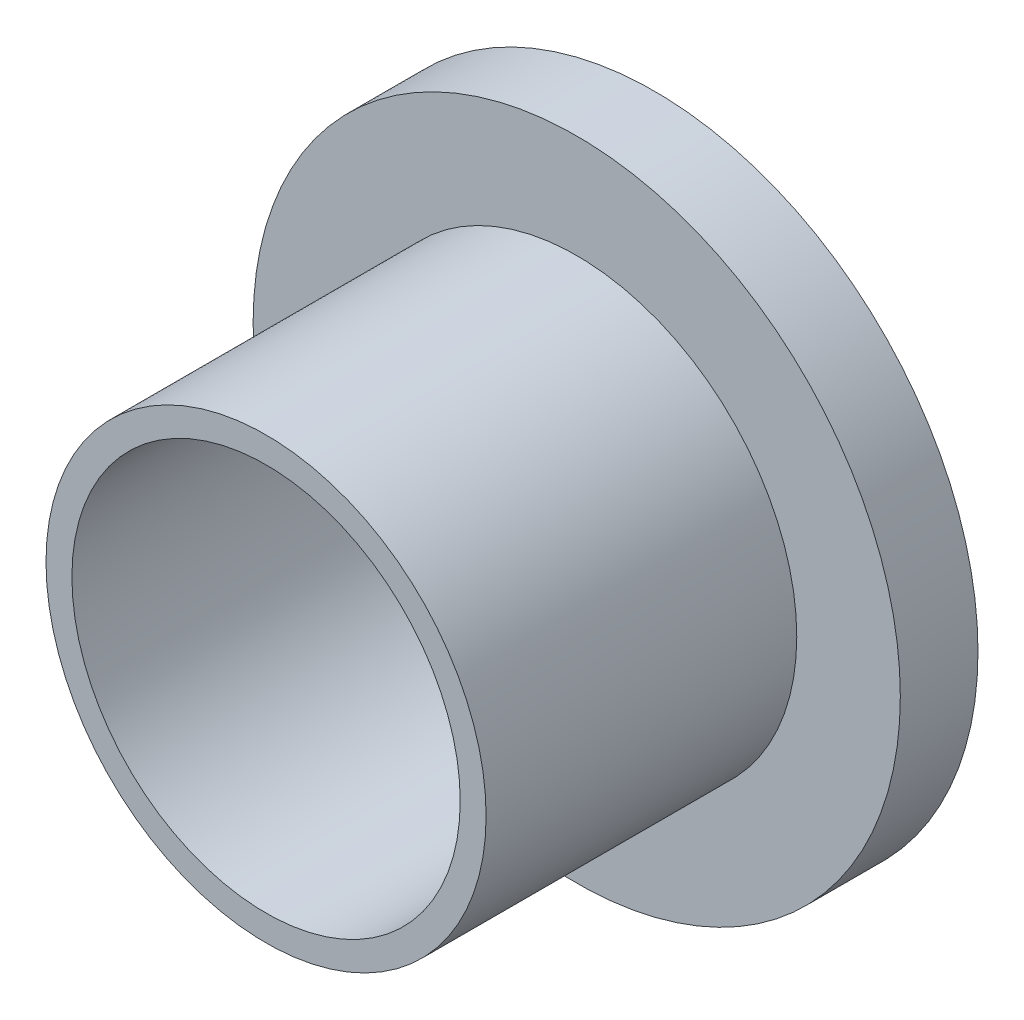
from build123d import *
from build123d.topology import SkipClean

# Parameters (mm, degrees)
SKETCH1_R           = 8.5
SKETCH1_R_2         = 7.5
BOSS_EXTRUDE1_DEPTH = 12
BOSS_EXTRUDE2_START = 3
SKETCH2_R           = 12.5
SKETCH2_R_2         = 7.5
BOSS_EXTRUDE2_DEPTH = 3


with BuildPart() as part:
    # Sketch1 → Boss-Extrude1 (new body)
    with BuildSketch(Plane.XY):
        Circle(SKETCH1_R)
        Circle(SKETCH1_R_2, mode=Mode.SUBTRACT)
    extrude(amount=BOSS_EXTRUDE1_DEPTH)

    # Sketch2 → Boss-Extrude2 (add)
    with SkipClean():  # the faces are left unmerged after this step: merging them gives an invalid solid
        with BuildSketch(Plane(origin=(0, 0, 0), x_dir=(-1, 0, 0), z_dir=(0, 0, -1)).offset(BOSS_EXTRUDE2_START)):
            Circle(SKETCH2_R)
            Circle(SKETCH2_R_2, mode=Mode.SUBTRACT)
        extrude(amount=-BOSS_EXTRUDE2_DEPTH)


solid = part.part
